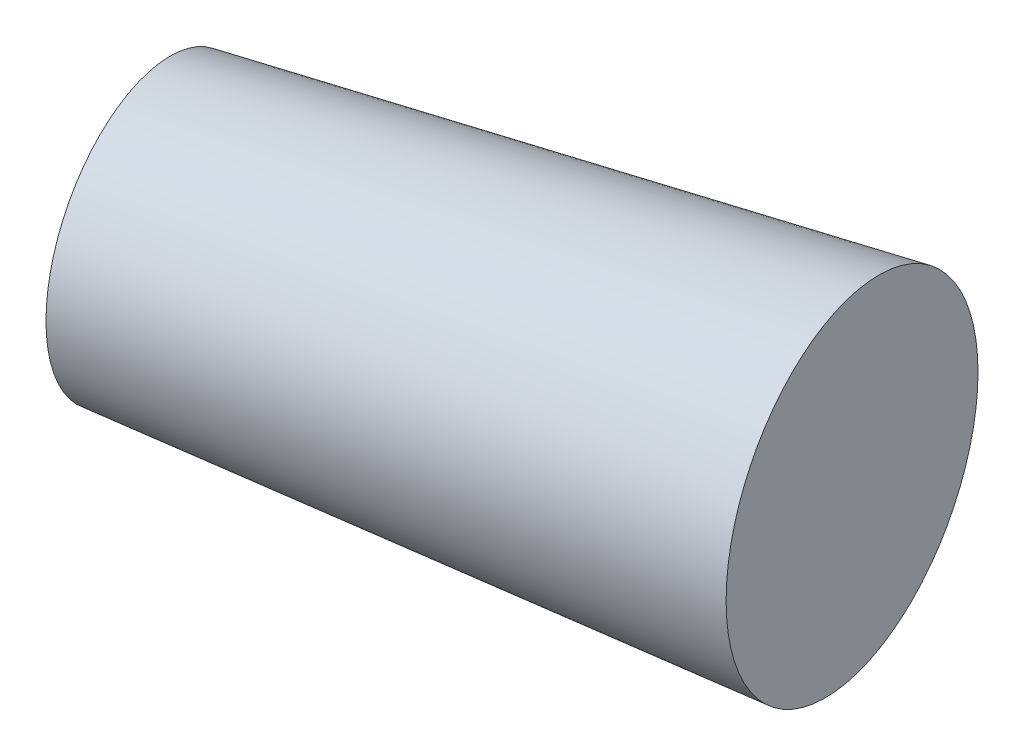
from build123d import *


with BuildPart() as part:
    # Esquisse1 → Base-R_volution (revolve)
    with BuildSketch(Plane(origin=(0, 0, 0), x_dir=(1, 0, 0), z_dir=(0, 1, 0)), mode=Mode.PRIVATE) as base_r_volution_sk:
        Polygon((-6.139848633, -1.364410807), (3.403441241, 0.756320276), (2.806882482, 3.440834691), (-6.625264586, 0.819960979), align=None)
    revolve(base_r_volution_sk.sketch.rotate(Axis((0, 0, 0), (0.9761870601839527, 0, -0.2169304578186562)), 180), axis=Axis((0, 0, 0), (0.9761870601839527, 0, -0.2169304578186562)))


solid = part.part
